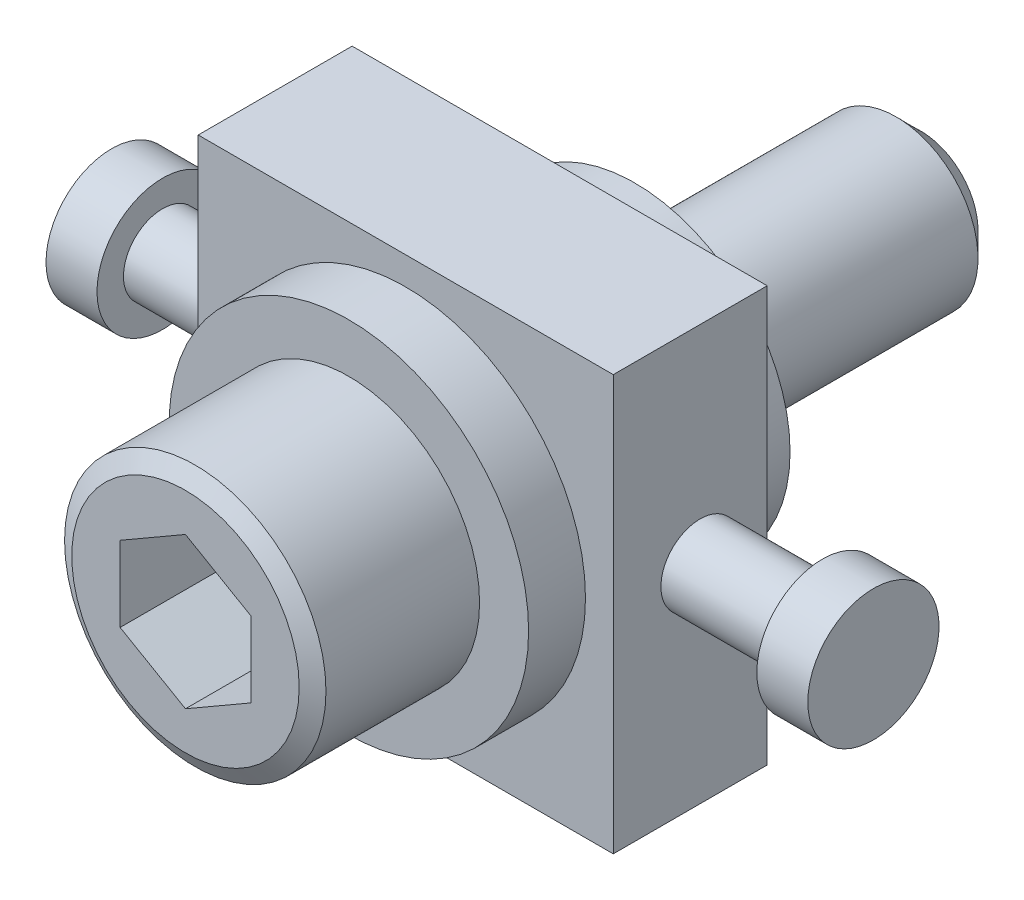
ISO-10303-21;
HEADER;
FILE_DESCRIPTION(('STEP AP214'),'2;1');
FILE_NAME('part.step','',(''),(''),'','','');
FILE_SCHEMA(('AUTOMOTIVE_DESIGN { 1 0 10303 214 1 1 1 1 }'));
ENDSEC;
DATA;
#1=APPLICATION_CONTEXT('core data for automotive mechanical design processes');
#2=APPLICATION_PROTOCOL_DEFINITION('international standard','automotive_design',2000,#1);
#3=PRODUCT_CONTEXT('',#1,'mechanical');
#4=PRODUCT('Part','Part','',(#3));
#5=PRODUCT_RELATED_PRODUCT_CATEGORY('part','',(#4));
#6=PRODUCT_DEFINITION_FORMATION('','',#4);
#7=PRODUCT_DEFINITION_CONTEXT('part definition',#1,'design');
#8=PRODUCT_DEFINITION('design','',#6,#7);
#9=PRODUCT_DEFINITION_SHAPE('','',#8);
#10=(LENGTH_UNIT() NAMED_UNIT(*) SI_UNIT(.MILLI.,.METRE.));
#11=(NAMED_UNIT(*) PLANE_ANGLE_UNIT() SI_UNIT($,.RADIAN.));
#12=(NAMED_UNIT(*) SI_UNIT($,.STERADIAN.) SOLID_ANGLE_UNIT());
#13=UNCERTAINTY_MEASURE_WITH_UNIT(LENGTH_MEASURE(1.E-05),#10,'distance_accuracy_value','');
#14=(GEOMETRIC_REPRESENTATION_CONTEXT(3) GLOBAL_UNCERTAINTY_ASSIGNED_CONTEXT((#13)) GLOBAL_UNIT_ASSIGNED_CONTEXT((#10,
#11,#12)) REPRESENTATION_CONTEXT('',''));
#15=CARTESIAN_POINT('',(0.,0.,0.));
#16=DIRECTION('',(0.,0.,1.));
#17=DIRECTION('',(1.,0.,0.));
#18=AXIS2_PLACEMENT_3D('',#15,#16,#17);
#19=CARTESIAN_POINT('',(20.7,0.,8.71));
#20=DIRECTION('',(-1.,0.,0.));
#21=DIRECTION('',(0.,0.,1.));
#22=AXIS2_PLACEMENT_3D('',#19,#20,#21);
#23=CYLINDRICAL_SURFACE('',#22,2.395);
#24=CARTESIAN_POINT('',(12.7,0.,8.71));
#25=DIRECTION('',(1.,0.,0.));
#26=DIRECTION('',(0.,0.,-1.));
#27=AXIS2_PLACEMENT_3D('',#24,#25,#26);
#28=CIRCLE('',#27,2.395);
#29=CARTESIAN_POINT('',(12.7,0.,6.315));
#30=VERTEX_POINT('',#29);
#31=EDGE_CURVE('E133',#30,#30,#28,.T.);
#32=ORIENTED_EDGE('',*,*,#31,.T.);
#33=EDGE_LOOP('',(#32));
#34=FACE_BOUND('',#33,.T.);
#35=CARTESIAN_POINT('',(20.19,0.,8.71));
#36=DIRECTION('',(1.,0.,0.));
#37=DIRECTION('',(0.,0.,-1.));
#38=AXIS2_PLACEMENT_3D('',#35,#36,#37);
#39=CIRCLE('',#38,2.395);
#40=CARTESIAN_POINT('',(20.19,0.,6.315));
#41=VERTEX_POINT('',#40);
#42=EDGE_CURVE('E128',#41,#41,#39,.T.);
#43=ORIENTED_EDGE('',*,*,#42,.F.);
#44=EDGE_LOOP('',(#43));
#45=FACE_BOUND('',#44,.T.);
#46=ADVANCED_FACE('F14',(#34,#45),#23,.T.);
#47=CARTESIAN_POINT('',(-20.7,0.,8.71));
#48=DIRECTION('',(1.,0.,0.));
#49=DIRECTION('',(0.,0.,-1.));
#50=AXIS2_PLACEMENT_3D('',#47,#48,#49);
#51=CYLINDRICAL_SURFACE('',#50,2.395);
#52=CARTESIAN_POINT('',(-12.7,0.,8.71));
#53=DIRECTION('',(1.,0.,0.));
#54=DIRECTION('',(0.,0.,-1.));
#55=AXIS2_PLACEMENT_3D('',#52,#53,#54);
#56=CIRCLE('',#55,2.395);
#57=CARTESIAN_POINT('',(-12.7,0.,6.315));
#58=VERTEX_POINT('',#57);
#59=EDGE_CURVE('E76',#58,#58,#56,.T.);
#60=ORIENTED_EDGE('',*,*,#59,.F.);
#61=EDGE_LOOP('',(#60));
#62=FACE_BOUND('',#61,.T.);
#63=CARTESIAN_POINT('',(-20.19,0.,8.71));
#64=DIRECTION('',(-1.,0.,0.));
#65=DIRECTION('',(0.,-1.,0.));
#66=AXIS2_PLACEMENT_3D('',#63,#64,#65);
#67=CIRCLE('',#66,2.395);
#68=CARTESIAN_POINT('',(-20.19,-2.395,8.71));
#69=VERTEX_POINT('',#68);
#70=EDGE_CURVE('E87',#69,#69,#67,.F.);
#71=ORIENTED_EDGE('',*,*,#70,.T.);
#72=EDGE_LOOP('',(#71));
#73=FACE_BOUND('',#72,.T.);
#74=ADVANCED_FACE('F164',(#62,#73),#51,.T.);
#75=CARTESIAN_POINT('',(-12.7,12.7,-150.));
#76=DIRECTION('',(-1.,0.,0.));
#77=DIRECTION('',(0.,-1.,0.));
#78=AXIS2_PLACEMENT_3D('',#75,#76,#77);
#79=PLANE('',#78);
#80=DIRECTION('',(0.,-1.,0.));
#81=VECTOR('',#80,1.);
#82=CARTESIAN_POINT('',(-12.7,0.,4.6));
#83=LINE('',#82,#81);
#84=CARTESIAN_POINT('',(-12.7,12.7,4.6));
#85=VERTEX_POINT('',#84);
#86=CARTESIAN_POINT('',(-12.7,-12.7,4.6));
#87=VERTEX_POINT('',#86);
#88=EDGE_CURVE('E77',#85,#87,#83,.T.);
#89=ORIENTED_EDGE('',*,*,#88,.T.);
#90=DIRECTION('',(0.,0.,1.));
#91=VECTOR('',#90,1.);
#92=CARTESIAN_POINT('',(-12.7,-12.7,-150.));
#93=LINE('',#92,#91);
#94=CARTESIAN_POINT('',(-12.7,-12.7,14.02));
#95=VERTEX_POINT('',#94);
#96=EDGE_CURVE('E66',#87,#95,#93,.T.);
#97=ORIENTED_EDGE('',*,*,#96,.T.);
#98=DIRECTION('',(0.,-1.,0.));
#99=VECTOR('',#98,1.);
#100=CARTESIAN_POINT('',(-12.7,0.,14.02));
#101=LINE('',#100,#99);
#102=CARTESIAN_POINT('',(-12.7,12.7,14.02));
#103=VERTEX_POINT('',#102);
#104=EDGE_CURVE('E118',#103,#95,#101,.T.);
#105=ORIENTED_EDGE('',*,*,#104,.F.);
#106=DIRECTION('',(0.,0.,1.));
#107=VECTOR('',#106,1.);
#108=CARTESIAN_POINT('',(-12.7,12.7,-150.));
#109=LINE('',#108,#107);
#110=EDGE_CURVE('E84',#85,#103,#109,.T.);
#111=ORIENTED_EDGE('',*,*,#110,.F.);
#112=EDGE_LOOP('',(#89,#97,#105,#111));
#113=FACE_BOUND('',#112,.T.);
#114=ORIENTED_EDGE('',*,*,#59,.T.);
#115=EDGE_LOOP('',(#114));
#116=FACE_BOUND('',#115,.T.);
#117=ADVANCED_FACE('F81',(#113,#116),#79,.T.);
#118=CARTESIAN_POINT('',(0.,0.,4.6));
#119=DIRECTION('',(0.,0.,1.));
#120=DIRECTION('',(1.,0.,0.));
#121=AXIS2_PLACEMENT_3D('',#118,#119,#120);
#122=PLANE('',#121);
#123=CARTESIAN_POINT('',(0.,0.,4.6));
#124=DIRECTION('',(0.,0.,1.));
#125=DIRECTION('',(1.,0.,0.));
#126=AXIS2_PLACEMENT_3D('',#123,#124,#125);
#127=CIRCLE('',#126,9.5);
#128=CARTESIAN_POINT('',(9.5,0.,4.6));
#129=VERTEX_POINT('',#128);
#130=EDGE_CURVE('E98',#129,#129,#127,.T.);
#131=ORIENTED_EDGE('',*,*,#130,.T.);
#132=EDGE_LOOP('',(#131));
#133=FACE_BOUND('',#132,.T.);
#134=ORIENTED_EDGE('',*,*,#88,.F.);
#135=DIRECTION('',(1.,0.,0.));
#136=VECTOR('',#135,1.);
#137=CARTESIAN_POINT('',(0.,12.7,4.6));
#138=LINE('',#137,#136);
#139=CARTESIAN_POINT('',(12.7,12.7,4.6));
#140=VERTEX_POINT('',#139);
#141=EDGE_CURVE('E93',#85,#140,#138,.T.);
#142=ORIENTED_EDGE('',*,*,#141,.T.);
#143=DIRECTION('',(0.,1.,0.));
#144=VECTOR('',#143,1.);
#145=CARTESIAN_POINT('',(12.7,0.,4.6));
#146=LINE('',#145,#144);
#147=CARTESIAN_POINT('',(12.7,-12.7,4.6));
#148=VERTEX_POINT('',#147);
#149=EDGE_CURVE('E91',#148,#140,#146,.T.);
#150=ORIENTED_EDGE('',*,*,#149,.F.);
#151=DIRECTION('',(-1.,0.,0.));
#152=VECTOR('',#151,1.);
#153=CARTESIAN_POINT('',(0.,-12.7,4.6));
#154=LINE('',#153,#152);
#155=EDGE_CURVE('E70',#148,#87,#154,.T.);
#156=ORIENTED_EDGE('',*,*,#155,.T.);
#157=EDGE_LOOP('',(#134,#142,#150,#156));
#158=FACE_BOUND('',#157,.T.);
#159=ADVANCED_FACE('F90',(#133,#158),#122,.F.);
#160=CARTESIAN_POINT('',(0.,0.,0.));
#161=DIRECTION('',(0.,0.,1.));
#162=DIRECTION('',(1.,0.,0.));
#163=AXIS2_PLACEMENT_3D('',#160,#161,#162);
#164=PLANE('',#163);
#165=CARTESIAN_POINT('',(0.,0.,0.));
#166=DIRECTION('',(0.,0.,1.));
#167=DIRECTION('',(1.,0.,0.));
#168=AXIS2_PLACEMENT_3D('',#165,#166,#167);
#169=CIRCLE('',#168,9.5);
#170=CARTESIAN_POINT('',(9.5,0.,0.));
#171=VERTEX_POINT('',#170);
#172=EDGE_CURVE('E92',#171,#171,#169,.T.);
#173=ORIENTED_EDGE('',*,*,#172,.F.);
#174=EDGE_LOOP('',(#173));
#175=FACE_BOUND('',#174,.T.);
#176=CARTESIAN_POINT('',(0.,0.,0.));
#177=DIRECTION('',(0.,0.,-1.));
#178=DIRECTION('',(-1.,0.,0.));
#179=AXIS2_PLACEMENT_3D('',#176,#177,#178);
#180=CIRCLE('',#179,5.);
#181=CARTESIAN_POINT('',(-5.,0.,0.));
#182=VERTEX_POINT('',#181);
#183=EDGE_CURVE('E106',#182,#182,#180,.T.);
#184=ORIENTED_EDGE('',*,*,#183,.F.);
#185=EDGE_LOOP('',(#184));
#186=FACE_BOUND('',#185,.T.);
#187=ADVANCED_FACE('F211',(#175,#186),#164,.F.);
#188=CARTESIAN_POINT('',(0.,0.,4.6));
#189=DIRECTION('',(0.,0.,-1.));
#190=DIRECTION('',(-1.,0.,0.));
#191=AXIS2_PLACEMENT_3D('',#188,#189,#190);
#192=CYLINDRICAL_SURFACE('',#191,9.5);
#193=ORIENTED_EDGE('',*,*,#130,.F.);
#194=EDGE_LOOP('',(#193));
#195=FACE_BOUND('',#194,.T.);
#196=ORIENTED_EDGE('',*,*,#172,.T.);
#197=EDGE_LOOP('',(#196));
#198=FACE_BOUND('',#197,.T.);
#199=ADVANCED_FACE('F194',(#195,#198),#192,.T.);
#200=CARTESIAN_POINT('',(0.,0.,-17.5));
#201=DIRECTION('',(0.,0.,1.));
#202=DIRECTION('',(1.,0.,0.));
#203=AXIS2_PLACEMENT_3D('',#200,#201,#202);
#204=CYLINDRICAL_SURFACE('',#203,5.);
#205=CARTESIAN_POINT('',(0.,0.,-16.));
#206=DIRECTION('',(0.,0.,-1.));
#207=DIRECTION('',(-1.,0.,0.));
#208=AXIS2_PLACEMENT_3D('',#205,#206,#207);
#209=CIRCLE('',#208,5.);
#210=CARTESIAN_POINT('',(-5.,0.,-16.));
#211=VERTEX_POINT('',#210);
#212=EDGE_CURVE('E96',#211,#211,#209,.F.);
#213=ORIENTED_EDGE('',*,*,#212,.T.);
#214=EDGE_LOOP('',(#213));
#215=FACE_BOUND('',#214,.T.);
#216=ORIENTED_EDGE('',*,*,#183,.T.);
#217=EDGE_LOOP('',(#216));
#218=FACE_BOUND('',#217,.T.);
#219=ADVANCED_FACE('F190',(#215,#218),#204,.T.);
#220=CARTESIAN_POINT('',(0.,0.,-17.5));
#221=DIRECTION('',(0.,0.,-1.));
#222=DIRECTION('',(-1.,0.,0.));
#223=AXIS2_PLACEMENT_3D('',#220,#221,#222);
#224=PLANE('',#223);
#225=CARTESIAN_POINT('',(0.,0.,-17.5));
#226=DIRECTION('',(0.,0.,-1.));
#227=DIRECTION('',(-1.,0.,0.));
#228=AXIS2_PLACEMENT_3D('',#225,#226,#227);
#229=CIRCLE('',#228,3.5);
#230=CARTESIAN_POINT('',(-3.5,0.,-17.5));
#231=VERTEX_POINT('',#230);
#232=EDGE_CURVE('E109',#231,#231,#229,.T.);
#233=ORIENTED_EDGE('',*,*,#232,.T.);
#234=EDGE_LOOP('',(#233));
#235=FACE_BOUND('',#234,.T.);
#236=ADVANCED_FACE('F188',(#235),#224,.T.);
#237=CARTESIAN_POINT('',(-12.7,12.7,-150.));
#238=DIRECTION('',(0.,-1.,0.));
#239=DIRECTION('',(1.,0.,0.));
#240=AXIS2_PLACEMENT_3D('',#237,#238,#239);
#241=PLANE('',#240);
#242=ORIENTED_EDGE('',*,*,#110,.T.);
#243=DIRECTION('',(1.,0.,0.));
#244=VECTOR('',#243,1.);
#245=CARTESIAN_POINT('',(0.,12.7,14.02));
#246=LINE('',#245,#244);
#247=CARTESIAN_POINT('',(12.7,12.7,14.02));
#248=VERTEX_POINT('',#247);
#249=EDGE_CURVE('E104',#103,#248,#246,.T.);
#250=ORIENTED_EDGE('',*,*,#249,.T.);
#251=DIRECTION('',(0.,0.,1.));
#252=VECTOR('',#251,1.);
#253=CARTESIAN_POINT('',(12.7,12.7,-150.));
#254=LINE('',#253,#252);
#255=EDGE_CURVE('E103',#140,#248,#254,.T.);
#256=ORIENTED_EDGE('',*,*,#255,.F.);
#257=ORIENTED_EDGE('',*,*,#141,.F.);
#258=EDGE_LOOP('',(#242,#250,#256,#257));
#259=FACE_BOUND('',#258,.T.);
#260=ADVANCED_FACE('F184',(#259),#241,.F.);
#261=CARTESIAN_POINT('',(12.7,-12.7,-150.));
#262=DIRECTION('',(1.,0.,0.));
#263=DIRECTION('',(0.,0.,-1.));
#264=AXIS2_PLACEMENT_3D('',#261,#262,#263);
#265=PLANE('',#264);
#266=ORIENTED_EDGE('',*,*,#31,.F.);
#267=EDGE_LOOP('',(#266));
#268=FACE_BOUND('',#267,.T.);
#269=ORIENTED_EDGE('',*,*,#149,.T.);
#270=ORIENTED_EDGE('',*,*,#255,.T.);
#271=DIRECTION('',(0.,1.,0.));
#272=VECTOR('',#271,1.);
#273=CARTESIAN_POINT('',(12.7,0.,14.02));
#274=LINE('',#273,#272);
#275=CARTESIAN_POINT('',(12.7,-12.7,14.02));
#276=VERTEX_POINT('',#275);
#277=EDGE_CURVE('E125',#276,#248,#274,.T.);
#278=ORIENTED_EDGE('',*,*,#277,.F.);
#279=DIRECTION('',(0.,0.,1.));
#280=VECTOR('',#279,1.);
#281=CARTESIAN_POINT('',(12.7,-12.7,-150.));
#282=LINE('',#281,#280);
#283=EDGE_CURVE('E124',#148,#276,#282,.T.);
#284=ORIENTED_EDGE('',*,*,#283,.F.);
#285=EDGE_LOOP('',(#269,#270,#278,#284));
#286=FACE_BOUND('',#285,.T.);
#287=ADVANCED_FACE('F181',(#268,#286),#265,.T.);
#288=CARTESIAN_POINT('',(12.7,-12.7,-150.));
#289=DIRECTION('',(0.,1.,0.));
#290=DIRECTION('',(-1.,0.,0.));
#291=AXIS2_PLACEMENT_3D('',#288,#289,#290);
#292=PLANE('',#291);
#293=ORIENTED_EDGE('',*,*,#283,.T.);
#294=DIRECTION('',(-1.,0.,0.));
#295=VECTOR('',#294,1.);
#296=CARTESIAN_POINT('',(0.,-12.7,14.02));
#297=LINE('',#296,#295);
#298=EDGE_CURVE('E73',#276,#95,#297,.T.);
#299=ORIENTED_EDGE('',*,*,#298,.T.);
#300=ORIENTED_EDGE('',*,*,#96,.F.);
#301=ORIENTED_EDGE('',*,*,#155,.F.);
#302=EDGE_LOOP('',(#293,#299,#300,#301));
#303=FACE_BOUND('',#302,.T.);
#304=ADVANCED_FACE('F68',(#303),#292,.F.);
#305=CARTESIAN_POINT('',(0.,0.,27.5));
#306=DIRECTION('',(0.,0.,-1.));
#307=DIRECTION('',(-1.,0.,0.));
#308=AXIS2_PLACEMENT_3D('',#305,#306,#307);
#309=CYLINDRICAL_SURFACE('',#308,8.);
#310=CARTESIAN_POINT('',(0.,0.,26.9));
#311=DIRECTION('',(0.,0.,1.));
#312=DIRECTION('',(1.,0.,0.));
#313=AXIS2_PLACEMENT_3D('',#310,#311,#312);
#314=CIRCLE('',#313,8.);
#315=CARTESIAN_POINT('',(8.,0.,26.9));
#316=VERTEX_POINT('',#315);
#317=EDGE_CURVE('E114',#316,#316,#314,.F.);
#318=ORIENTED_EDGE('',*,*,#317,.T.);
#319=EDGE_LOOP('',(#318));
#320=FACE_BOUND('',#319,.T.);
#321=CARTESIAN_POINT('',(0.,0.,17.5));
#322=DIRECTION('',(0.,0.,1.));
#323=DIRECTION('',(1.,0.,0.));
#324=AXIS2_PLACEMENT_3D('',#321,#322,#323);
#325=CIRCLE('',#324,8.);
#326=CARTESIAN_POINT('',(8.,0.,17.5));
#327=VERTEX_POINT('',#326);
#328=EDGE_CURVE('E110',#327,#327,#325,.T.);
#329=ORIENTED_EDGE('',*,*,#328,.T.);
#330=EDGE_LOOP('',(#329));
#331=FACE_BOUND('',#330,.T.);
#332=ADVANCED_FACE('F143',(#320,#331),#309,.T.);
#333=CARTESIAN_POINT('',(0.,0.,17.5));
#334=DIRECTION('',(0.,0.,1.));
#335=DIRECTION('',(1.,0.,0.));
#336=AXIS2_PLACEMENT_3D('',#333,#334,#335);
#337=PLANE('',#336);
#338=ORIENTED_EDGE('',*,*,#328,.F.);
#339=EDGE_LOOP('',(#338));
#340=FACE_BOUND('',#339,.T.);
#341=CARTESIAN_POINT('',(0.,0.,17.5));
#342=DIRECTION('',(0.,0.,1.));
#343=DIRECTION('',(1.,0.,0.));
#344=AXIS2_PLACEMENT_3D('',#341,#342,#343);
#345=CIRCLE('',#344,11.);
#346=CARTESIAN_POINT('',(11.,0.,17.5));
#347=VERTEX_POINT('',#346);
#348=EDGE_CURVE('E113',#347,#347,#345,.T.);
#349=ORIENTED_EDGE('',*,*,#348,.T.);
#350=EDGE_LOOP('',(#349));
#351=FACE_BOUND('',#350,.T.);
#352=ADVANCED_FACE('F200',(#340,#351),#337,.T.);
#353=CARTESIAN_POINT('',(0.,0.,17.5));
#354=DIRECTION('',(0.,0.,-1.));
#355=DIRECTION('',(-1.,0.,0.));
#356=AXIS2_PLACEMENT_3D('',#353,#354,#355);
#357=CYLINDRICAL_SURFACE('',#356,11.);
#358=ORIENTED_EDGE('',*,*,#348,.F.);
#359=EDGE_LOOP('',(#358));
#360=FACE_BOUND('',#359,.T.);
#361=CARTESIAN_POINT('',(0.,0.,14.02));
#362=DIRECTION('',(0.,0.,1.));
#363=DIRECTION('',(1.,0.,0.));
#364=AXIS2_PLACEMENT_3D('',#361,#362,#363);
#365=CIRCLE('',#364,11.);
#366=CARTESIAN_POINT('',(11.,0.,14.02));
#367=VERTEX_POINT('',#366);
#368=EDGE_CURVE('E115',#367,#367,#365,.T.);
#369=ORIENTED_EDGE('',*,*,#368,.T.);
#370=EDGE_LOOP('',(#369));
#371=FACE_BOUND('',#370,.T.);
#372=ADVANCED_FACE('F203',(#360,#371),#357,.T.);
#373=CARTESIAN_POINT('',(0.,0.,14.02));
#374=DIRECTION('',(0.,0.,1.));
#375=DIRECTION('',(1.,0.,0.));
#376=AXIS2_PLACEMENT_3D('',#373,#374,#375);
#377=PLANE('',#376);
#378=ORIENTED_EDGE('',*,*,#368,.F.);
#379=EDGE_LOOP('',(#378));
#380=FACE_BOUND('',#379,.T.);
#381=ORIENTED_EDGE('',*,*,#249,.F.);
#382=ORIENTED_EDGE('',*,*,#104,.T.);
#383=ORIENTED_EDGE('',*,*,#298,.F.);
#384=ORIENTED_EDGE('',*,*,#277,.T.);
#385=EDGE_LOOP('',(#381,#382,#383,#384));
#386=FACE_BOUND('',#385,.T.);
#387=ADVANCED_FACE('F207',(#380,#386),#377,.T.);
#388=CARTESIAN_POINT('',(20.19,0.,8.71));
#389=DIRECTION('',(1.,0.,0.));
#390=DIRECTION('',(0.,0.,1.));
#391=AXIS2_PLACEMENT_3D('',#388,#389,#390);
#392=PLANE('',#391);
#393=ORIENTED_EDGE('',*,*,#42,.T.);
#394=EDGE_LOOP('',(#393));
#395=FACE_BOUND('',#394,.T.);
#396=CARTESIAN_POINT('',(20.19,0.,8.71));
#397=DIRECTION('',(1.,0.,0.));
#398=DIRECTION('',(0.,0.,1.));
#399=AXIS2_PLACEMENT_3D('',#396,#397,#398);
#400=CIRCLE('',#399,4.015);
#401=CARTESIAN_POINT('',(20.19,0.,12.725));
#402=VERTEX_POINT('',#401);
#403=EDGE_CURVE('E272',#402,#402,#400,.T.);
#404=ORIENTED_EDGE('',*,*,#403,.F.);
#405=EDGE_LOOP('',(#404));
#406=FACE_BOUND('',#405,.T.);
#407=ADVANCED_FACE('F215',(#395,#406),#392,.F.);
#408=CARTESIAN_POINT('',(-20.19,0.,8.71));
#409=DIRECTION('',(-1.,0.,0.));
#410=DIRECTION('',(0.,0.,1.));
#411=AXIS2_PLACEMENT_3D('',#408,#409,#410);
#412=PLANE('',#411);
#413=ORIENTED_EDGE('',*,*,#70,.F.);
#414=EDGE_LOOP('',(#413));
#415=FACE_BOUND('',#414,.T.);
#416=CARTESIAN_POINT('',(-20.19,0.,8.71));
#417=DIRECTION('',(1.,0.,0.));
#418=DIRECTION('',(0.,0.,1.));
#419=AXIS2_PLACEMENT_3D('',#416,#417,#418);
#420=CIRCLE('',#419,4.015);
#421=CARTESIAN_POINT('',(-20.19,0.,12.725));
#422=VERTEX_POINT('',#421);
#423=EDGE_CURVE('E24',#422,#422,#420,.T.);
#424=ORIENTED_EDGE('',*,*,#423,.T.);
#425=EDGE_LOOP('',(#424));
#426=FACE_BOUND('',#425,.T.);
#427=ADVANCED_FACE('F225',(#415,#426),#412,.F.);
#428=CARTESIAN_POINT('',(0.,0.,-17.5));
#429=DIRECTION('',(0.,0.,1.));
#430=DIRECTION('',(1.,0.,0.));
#431=AXIS2_PLACEMENT_3D('',#428,#429,#430);
#432=CONICAL_SURFACE('',#431,3.5,0.785398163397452);
#433=ORIENTED_EDGE('',*,*,#212,.F.);
#434=EDGE_LOOP('',(#433));
#435=FACE_BOUND('',#434,.T.);
#436=ORIENTED_EDGE('',*,*,#232,.F.);
#437=EDGE_LOOP('',(#436));
#438=FACE_BOUND('',#437,.T.);
#439=ADVANCED_FACE('F222',(#435,#438),#432,.T.);
#440=CARTESIAN_POINT('',(0.,4.61880215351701,21.5));
#441=DIRECTION('',(0.,0.,1.));
#442=DIRECTION('',(1.,0.,0.));
#443=AXIS2_PLACEMENT_3D('',#440,#441,#442);
#444=PLANE('',#443);
#445=DIRECTION('',(-0.866025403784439,0.5,0.));
#446=VECTOR('',#445,1.);
#447=CARTESIAN_POINT('',(4.,2.30940107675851,21.5));
#448=LINE('',#447,#446);
#449=CARTESIAN_POINT('',(4.,2.30940107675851,21.5));
#450=VERTEX_POINT('',#449);
#451=CARTESIAN_POINT('',(0.,4.61880215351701,21.5));
#452=VERTEX_POINT('',#451);
#453=EDGE_CURVE('E136',#450,#452,#448,.T.);
#454=ORIENTED_EDGE('',*,*,#453,.T.);
#455=DIRECTION('',(-0.866025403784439,-0.5,0.));
#456=VECTOR('',#455,1.);
#457=CARTESIAN_POINT('',(0.,4.61880215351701,21.5));
#458=LINE('',#457,#456);
#459=CARTESIAN_POINT('',(-4.,2.30940107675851,21.5));
#460=VERTEX_POINT('',#459);
#461=EDGE_CURVE('E336',#452,#460,#458,.T.);
#462=ORIENTED_EDGE('',*,*,#461,.T.);
#463=DIRECTION('',(0.,-1.,0.));
#464=VECTOR('',#463,1.);
#465=CARTESIAN_POINT('',(-4.,2.30940107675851,21.5));
#466=LINE('',#465,#464);
#467=CARTESIAN_POINT('',(-4.,-2.30940107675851,21.5));
#468=VERTEX_POINT('',#467);
#469=EDGE_CURVE('E333',#460,#468,#466,.T.);
#470=ORIENTED_EDGE('',*,*,#469,.T.);
#471=DIRECTION('',(0.866025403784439,-0.5,0.));
#472=VECTOR('',#471,1.);
#473=CARTESIAN_POINT('',(-4.,-2.30940107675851,21.5));
#474=LINE('',#473,#472);
#475=CARTESIAN_POINT('',(0.,-4.61880215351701,21.5));
#476=VERTEX_POINT('',#475);
#477=EDGE_CURVE('E330',#468,#476,#474,.T.);
#478=ORIENTED_EDGE('',*,*,#477,.T.);
#479=DIRECTION('',(0.866025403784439,0.5,0.));
#480=VECTOR('',#479,1.);
#481=CARTESIAN_POINT('',(0.,-4.61880215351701,21.5));
#482=LINE('',#481,#480);
#483=CARTESIAN_POINT('',(4.,-2.30940107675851,21.5));
#484=VERTEX_POINT('',#483);
#485=EDGE_CURVE('E327',#476,#484,#482,.T.);
#486=ORIENTED_EDGE('',*,*,#485,.T.);
#487=DIRECTION('',(0.,1.,0.));
#488=VECTOR('',#487,1.);
#489=CARTESIAN_POINT('',(4.,-2.30940107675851,21.5));
#490=LINE('',#489,#488);
#491=EDGE_CURVE('E323',#484,#450,#490,.T.);
#492=ORIENTED_EDGE('',*,*,#491,.T.);
#493=EDGE_LOOP('',(#454,#462,#470,#478,#486,#492));
#494=FACE_BOUND('',#493,.T.);
#495=ADVANCED_FACE('F224',(#494),#444,.T.);
#496=CARTESIAN_POINT('',(0.,4.61880215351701,21.5));
#497=DIRECTION('',(-0.5,0.866025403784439,0.));
#498=DIRECTION('',(-0.866025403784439,-0.5,0.));
#499=AXIS2_PLACEMENT_3D('',#496,#497,#498);
#500=PLANE('',#499);
#501=DIRECTION('',(-0.866025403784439,-0.5,0.));
#502=VECTOR('',#501,1.);
#503=CARTESIAN_POINT('',(0.,4.61880215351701,27.5));
#504=LINE('',#503,#502);
#505=CARTESIAN_POINT('',(0.,4.61880215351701,27.5));
#506=VERTEX_POINT('',#505);
#507=CARTESIAN_POINT('',(-4.,2.30940107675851,27.5));
#508=VERTEX_POINT('',#507);
#509=EDGE_CURVE('E296',#506,#508,#504,.T.);
#510=ORIENTED_EDGE('',*,*,#509,.T.);
#511=DIRECTION('',(0.,0.,1.));
#512=VECTOR('',#511,1.);
#513=CARTESIAN_POINT('',(-4.,2.30940107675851,21.5));
#514=LINE('',#513,#512);
#515=EDGE_CURVE('E297',#460,#508,#514,.T.);
#516=ORIENTED_EDGE('',*,*,#515,.F.);
#517=ORIENTED_EDGE('',*,*,#461,.F.);
#518=DIRECTION('',(0.,0.,1.));
#519=VECTOR('',#518,1.);
#520=CARTESIAN_POINT('',(0.,4.61880215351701,21.5));
#521=LINE('',#520,#519);
#522=EDGE_CURVE('E292',#452,#506,#521,.T.);
#523=ORIENTED_EDGE('',*,*,#522,.T.);
#524=EDGE_LOOP('',(#510,#516,#517,#523));
#525=FACE_BOUND('',#524,.T.);
#526=ADVANCED_FACE('F232',(#525),#500,.F.);
#527=CARTESIAN_POINT('',(-4.,2.30940107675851,21.5));
#528=DIRECTION('',(-1.,0.,0.));
#529=DIRECTION('',(0.,-1.,0.));
#530=AXIS2_PLACEMENT_3D('',#527,#528,#529);
#531=PLANE('',#530);
#532=DIRECTION('',(0.,-1.,0.));
#533=VECTOR('',#532,1.);
#534=CARTESIAN_POINT('',(-4.,2.30940107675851,27.5));
#535=LINE('',#534,#533);
#536=CARTESIAN_POINT('',(-4.,-2.30940107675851,27.5));
#537=VERTEX_POINT('',#536);
#538=EDGE_CURVE('E295',#508,#537,#535,.T.);
#539=ORIENTED_EDGE('',*,*,#538,.T.);
#540=DIRECTION('',(0.,0.,1.));
#541=VECTOR('',#540,1.);
#542=CARTESIAN_POINT('',(-4.,-2.30940107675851,21.5));
#543=LINE('',#542,#541);
#544=EDGE_CURVE('E301',#468,#537,#543,.T.);
#545=ORIENTED_EDGE('',*,*,#544,.F.);
#546=ORIENTED_EDGE('',*,*,#469,.F.);
#547=ORIENTED_EDGE('',*,*,#515,.T.);
#548=EDGE_LOOP('',(#539,#545,#546,#547));
#549=FACE_BOUND('',#548,.T.);
#550=ADVANCED_FACE('F369',(#549),#531,.F.);
#551=CARTESIAN_POINT('',(-4.,-2.30940107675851,21.5));
#552=DIRECTION('',(-0.5,-0.866025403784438,0.));
#553=DIRECTION('',(0.866025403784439,-0.5,0.));
#554=AXIS2_PLACEMENT_3D('',#551,#552,#553);
#555=PLANE('',#554);
#556=DIRECTION('',(0.866025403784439,-0.5,0.));
#557=VECTOR('',#556,1.);
#558=CARTESIAN_POINT('',(-4.,-2.30940107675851,27.5));
#559=LINE('',#558,#557);
#560=CARTESIAN_POINT('',(0.,-4.61880215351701,27.5));
#561=VERTEX_POINT('',#560);
#562=EDGE_CURVE('E300',#537,#561,#559,.T.);
#563=ORIENTED_EDGE('',*,*,#562,.T.);
#564=DIRECTION('',(0.,0.,1.));
#565=VECTOR('',#564,1.);
#566=CARTESIAN_POINT('',(0.,-4.61880215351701,21.5));
#567=LINE('',#566,#565);
#568=EDGE_CURVE('E305',#476,#561,#567,.T.);
#569=ORIENTED_EDGE('',*,*,#568,.F.);
#570=ORIENTED_EDGE('',*,*,#477,.F.);
#571=ORIENTED_EDGE('',*,*,#544,.T.);
#572=EDGE_LOOP('',(#563,#569,#570,#571));
#573=FACE_BOUND('',#572,.T.);
#574=ADVANCED_FACE('F370',(#573),#555,.F.);
#575=CARTESIAN_POINT('',(0.,-4.61880215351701,21.5));
#576=DIRECTION('',(0.5,-0.866025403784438,0.));
#577=DIRECTION('',(0.866025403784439,0.5,0.));
#578=AXIS2_PLACEMENT_3D('',#575,#576,#577);
#579=PLANE('',#578);
#580=DIRECTION('',(0.866025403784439,0.5,0.));
#581=VECTOR('',#580,1.);
#582=CARTESIAN_POINT('',(0.,-4.61880215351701,27.5));
#583=LINE('',#582,#581);
#584=CARTESIAN_POINT('',(4.,-2.30940107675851,27.5));
#585=VERTEX_POINT('',#584);
#586=EDGE_CURVE('E304',#561,#585,#583,.T.);
#587=ORIENTED_EDGE('',*,*,#586,.T.);
#588=DIRECTION('',(0.,0.,1.));
#589=VECTOR('',#588,1.);
#590=CARTESIAN_POINT('',(4.,-2.30940107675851,21.5));
#591=LINE('',#590,#589);
#592=EDGE_CURVE('E309',#484,#585,#591,.T.);
#593=ORIENTED_EDGE('',*,*,#592,.F.);
#594=ORIENTED_EDGE('',*,*,#485,.F.);
#595=ORIENTED_EDGE('',*,*,#568,.T.);
#596=EDGE_LOOP('',(#587,#593,#594,#595));
#597=FACE_BOUND('',#596,.T.);
#598=ADVANCED_FACE('F374',(#597),#579,.F.);
#599=CARTESIAN_POINT('',(4.,-2.30940107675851,21.5));
#600=DIRECTION('',(1.,0.,0.));
#601=DIRECTION('',(0.,0.,-1.));
#602=AXIS2_PLACEMENT_3D('',#599,#600,#601);
#603=PLANE('',#602);
#604=DIRECTION('',(0.,1.,0.));
#605=VECTOR('',#604,1.);
#606=CARTESIAN_POINT('',(4.,-2.30940107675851,27.5));
#607=LINE('',#606,#605);
#608=CARTESIAN_POINT('',(4.,2.30940107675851,27.5));
#609=VERTEX_POINT('',#608);
#610=EDGE_CURVE('E308',#585,#609,#607,.T.);
#611=ORIENTED_EDGE('',*,*,#610,.T.);
#612=DIRECTION('',(0.,0.,1.));
#613=VECTOR('',#612,1.);
#614=CARTESIAN_POINT('',(4.,2.30940107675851,21.5));
#615=LINE('',#614,#613);
#616=EDGE_CURVE('E33',#450,#609,#615,.T.);
#617=ORIENTED_EDGE('',*,*,#616,.F.);
#618=ORIENTED_EDGE('',*,*,#491,.F.);
#619=ORIENTED_EDGE('',*,*,#592,.T.);
#620=EDGE_LOOP('',(#611,#617,#618,#619));
#621=FACE_BOUND('',#620,.T.);
#622=ADVANCED_FACE('F381',(#621),#603,.F.);
#623=CARTESIAN_POINT('',(4.,2.30940107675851,21.5));
#624=DIRECTION('',(0.5,0.866025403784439,0.));
#625=DIRECTION('',(-0.866025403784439,0.5,0.));
#626=AXIS2_PLACEMENT_3D('',#623,#624,#625);
#627=PLANE('',#626);
#628=DIRECTION('',(-0.866025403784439,0.5,0.));
#629=VECTOR('',#628,1.);
#630=CARTESIAN_POINT('',(4.,2.30940107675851,27.5));
#631=LINE('',#630,#629);
#632=EDGE_CURVE('E312',#609,#506,#631,.T.);
#633=ORIENTED_EDGE('',*,*,#632,.T.);
#634=ORIENTED_EDGE('',*,*,#522,.F.);
#635=ORIENTED_EDGE('',*,*,#453,.F.);
#636=ORIENTED_EDGE('',*,*,#616,.T.);
#637=EDGE_LOOP('',(#633,#634,#635,#636));
#638=FACE_BOUND('',#637,.T.);
#639=ADVANCED_FACE('F159',(#638),#627,.F.);
#640=CARTESIAN_POINT('',(0.,0.,27.5));
#641=DIRECTION('',(0.,0.,1.));
#642=DIRECTION('',(1.,0.,0.));
#643=AXIS2_PLACEMENT_3D('',#640,#641,#642);
#644=PLANE('',#643);
#645=CARTESIAN_POINT('',(0.,0.,27.5));
#646=DIRECTION('',(0.,0.,1.));
#647=DIRECTION('',(1.,0.,0.));
#648=AXIS2_PLACEMENT_3D('',#645,#646,#647);
#649=CIRCLE('',#648,6.96076951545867);
#650=CARTESIAN_POINT('',(6.96076951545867,0.,27.5));
#651=VERTEX_POINT('',#650);
#652=EDGE_CURVE('E18',#651,#651,#649,.T.);
#653=ORIENTED_EDGE('',*,*,#652,.T.);
#654=EDGE_LOOP('',(#653));
#655=FACE_BOUND('',#654,.T.);
#656=ORIENTED_EDGE('',*,*,#632,.F.);
#657=ORIENTED_EDGE('',*,*,#610,.F.);
#658=ORIENTED_EDGE('',*,*,#586,.F.);
#659=ORIENTED_EDGE('',*,*,#562,.F.);
#660=ORIENTED_EDGE('',*,*,#538,.F.);
#661=ORIENTED_EDGE('',*,*,#509,.F.);
#662=EDGE_LOOP('',(#656,#657,#658,#659,#660,#661));
#663=FACE_BOUND('',#662,.T.);
#664=ADVANCED_FACE('F148',(#655,#663),#644,.T.);
#665=CARTESIAN_POINT('',(0.,0.,26.9));
#666=DIRECTION('',(0.,0.,-1.));
#667=DIRECTION('',(-1.,0.,0.));
#668=AXIS2_PLACEMENT_3D('',#665,#666,#667);
#669=CONICAL_SURFACE('',#668,8.,1.0471975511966);
#670=ORIENTED_EDGE('',*,*,#652,.F.);
#671=EDGE_LOOP('',(#670));
#672=FACE_BOUND('',#671,.T.);
#673=ORIENTED_EDGE('',*,*,#317,.F.);
#674=EDGE_LOOP('',(#673));
#675=FACE_BOUND('',#674,.T.);
#676=ADVANCED_FACE('F16',(#672,#675),#669,.T.);
#677=CARTESIAN_POINT('',(23.31,0.,8.71));
#678=DIRECTION('',(1.,0.,0.));
#679=DIRECTION('',(0.,0.,1.));
#680=AXIS2_PLACEMENT_3D('',#677,#678,#679);
#681=PLANE('',#680);
#682=CARTESIAN_POINT('',(23.31,0.,8.71));
#683=DIRECTION('',(1.,0.,0.));
#684=DIRECTION('',(0.,0.,1.));
#685=AXIS2_PLACEMENT_3D('',#682,#683,#684);
#686=CIRCLE('',#685,4.015);
#687=CARTESIAN_POINT('',(23.31,0.,12.725));
#688=VERTEX_POINT('',#687);
#689=EDGE_CURVE('E269',#688,#688,#686,.T.);
#690=ORIENTED_EDGE('',*,*,#689,.T.);
#691=EDGE_LOOP('',(#690));
#692=FACE_BOUND('',#691,.T.);
#693=ADVANCED_FACE('F147',(#692),#681,.T.);
#694=CARTESIAN_POINT('',(23.31,0.,8.71));
#695=DIRECTION('',(-1.,0.,0.));
#696=DIRECTION('',(0.,0.,-1.));
#697=AXIS2_PLACEMENT_3D('',#694,#695,#696);
#698=CYLINDRICAL_SURFACE('',#697,4.015);
#699=ORIENTED_EDGE('',*,*,#689,.F.);
#700=EDGE_LOOP('',(#699));
#701=FACE_BOUND('',#700,.T.);
#702=ORIENTED_EDGE('',*,*,#403,.T.);
#703=EDGE_LOOP('',(#702));
#704=FACE_BOUND('',#703,.T.);
#705=ADVANCED_FACE('F156',(#701,#704),#698,.T.);
#706=CARTESIAN_POINT('',(-23.31,0.,8.71));
#707=DIRECTION('',(-1.,0.,0.));
#708=DIRECTION('',(0.,0.,1.));
#709=AXIS2_PLACEMENT_3D('',#706,#707,#708);
#710=PLANE('',#709);
#711=CARTESIAN_POINT('',(-23.31,0.,8.71));
#712=DIRECTION('',(1.,0.,0.));
#713=DIRECTION('',(0.,0.,1.));
#714=AXIS2_PLACEMENT_3D('',#711,#712,#713);
#715=CIRCLE('',#714,4.015);
#716=CARTESIAN_POINT('',(-23.31,0.,12.725));
#717=VERTEX_POINT('',#716);
#718=EDGE_CURVE('E9',#717,#717,#715,.T.);
#719=ORIENTED_EDGE('',*,*,#718,.F.);
#720=EDGE_LOOP('',(#719));
#721=FACE_BOUND('',#720,.T.);
#722=ADVANCED_FACE('F254',(#721),#710,.T.);
#723=CARTESIAN_POINT('',(-23.31,0.,8.71));
#724=DIRECTION('',(1.,0.,0.));
#725=DIRECTION('',(0.,0.,1.));
#726=AXIS2_PLACEMENT_3D('',#723,#724,#725);
#727=CYLINDRICAL_SURFACE('',#726,4.015);
#728=ORIENTED_EDGE('',*,*,#718,.T.);
#729=EDGE_LOOP('',(#728));
#730=FACE_BOUND('',#729,.T.);
#731=ORIENTED_EDGE('',*,*,#423,.F.);
#732=EDGE_LOOP('',(#731));
#733=FACE_BOUND('',#732,.T.);
#734=ADVANCED_FACE('F257',(#730,#733),#727,.T.);
#735=CLOSED_SHELL('',(#46,#74,#117,#159,#187,#199,#219,#236,#260,#287,#304,#332,#352,#372,#387,
#407,#427,#439,#495,#526,#550,#574,#598,#622,#639,#664,#676,#693,#705,#722,#734));
#736=MANIFOLD_SOLID_BREP('B1',#735);
#737=ADVANCED_BREP_SHAPE_REPRESENTATION('',(#18,#736),#14);
#738=SHAPE_DEFINITION_REPRESENTATION(#9,#737);
ENDSEC;
END-ISO-10303-21;
